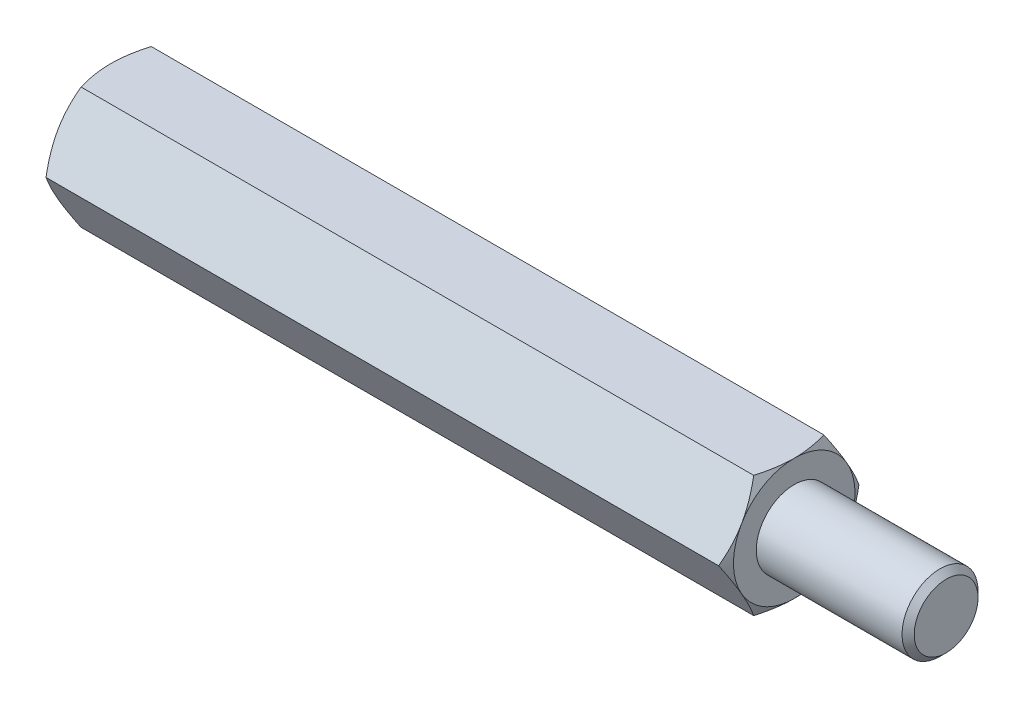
from build123d import *

# Parameters (mm, degrees)
EXTRUDE2_DEPTH = 22.5
SKETCH3_R      = 2.1
EXTRUDE3_DEPTH = 10
SKETCH5_R      = 2.5
EXTRUDE4_DEPTH = 10
CHAMFER1_SIZE  = 0.4


with BuildPart() as part:
    # Sketch1 → Extrude2 (new, symmetric)
    with BuildSketch(Plane(origin=(0, 0, 0), x_dir=(0, 0, -1), z_dir=(1, 0, 0))):
        Polygon((2.309401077, 4), (-2.309401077, 4), (-4.618802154, 0), (-2.309401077, -4), (2.309401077, -4), (4.618802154, 0), align=None)
    extrude(amount=EXTRUDE2_DEPTH, both=True)

    # Sketch2 → Cut-Revolve1 (revolve, cut)
    with BuildSketch(Plane.XY):
        with BuildLine():
            Line((-22.5, 4), (-21, 6.598076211))
            ThreePointArc((-21, 6.598076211), (-21.48810136, 7.776457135), (-22.5, 7))
            Line((-22.5, 7), (-22.5, 4))
        make_face()
    cut_revolve1 = revolve(axis=Axis((0, 0, 0), (1, 0, 0)), mode=Mode.SUBTRACT)

    # Mirror1: Cut-Revolve1 across plane
    add(cut_revolve1.mirror(Plane(origin=(0, 0, 0), x_dir=(0, 0, 1), z_dir=(1, 0, 0))), mode=Mode.SUBTRACT)

    # Sketch3 → Extrude3 (cut)
    with BuildSketch(Plane.ZY.offset(22.5)):
        Circle(SKETCH3_R)
    extrude(amount=-EXTRUDE3_DEPTH, mode=Mode.SUBTRACT)

    # Sketch4 → Cut-Revolve2 (revolve, cut)
    with BuildSketch(Plane.XY, mode=Mode.PRIVATE) as cut_revolve2_sk:
        Polygon((-12.5, 0), (-12.5, 2.1), (-11.287564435, 0), align=None)
    revolve(cut_revolve2_sk.sketch.rotate(Axis((-11.287564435, 0, 0), (-1, 0, 0)), 270), axis=Axis((-11.287564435, 0, 0), (-1, 0, 0)), mode=Mode.SUBTRACT)

    # Sketch5 → Extrude4 (add)
    with BuildSketch(Plane(origin=(22.5, 0, 0), x_dir=(0, 0, -1), z_dir=(1, 0, 0))):
        Circle(SKETCH5_R)
    extrude(amount=EXTRUDE4_DEPTH)

    # Chamfer1
    chamfer1_edges = [part.edges().sort_by_distance(p)[0] for p in [
        (32.5, 0, 2.5),
    ]]
    chamfer(chamfer1_edges, length=CHAMFER1_SIZE)


solid = part.part
